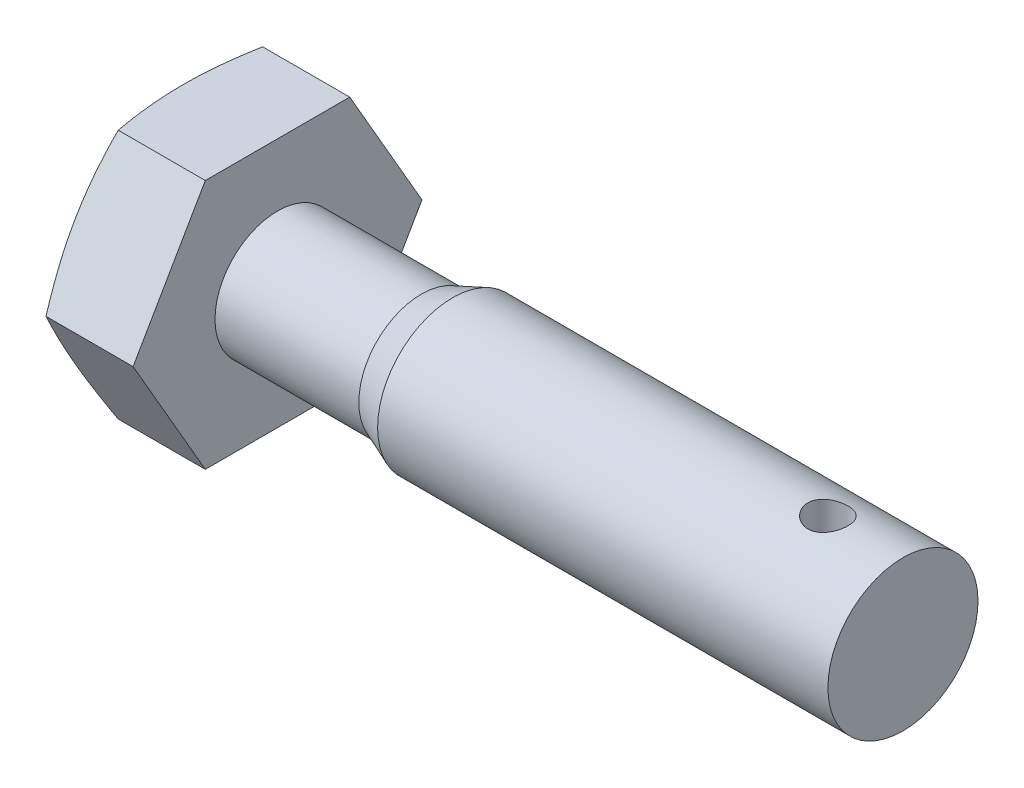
ISO-10303-21;
HEADER;
FILE_DESCRIPTION(('STEP AP214'),'2;1');
FILE_NAME('part.step','',(''),(''),'','','');
FILE_SCHEMA(('AUTOMOTIVE_DESIGN { 1 0 10303 214 1 1 1 1 }'));
ENDSEC;
DATA;
#1=APPLICATION_CONTEXT('core data for automotive mechanical design processes');
#2=APPLICATION_PROTOCOL_DEFINITION('international standard','automotive_design',2000,#1);
#3=PRODUCT_CONTEXT('',#1,'mechanical');
#4=PRODUCT('Part','Part','',(#3));
#5=PRODUCT_RELATED_PRODUCT_CATEGORY('part','',(#4));
#6=PRODUCT_DEFINITION_FORMATION('','',#4);
#7=PRODUCT_DEFINITION_CONTEXT('part definition',#1,'design');
#8=PRODUCT_DEFINITION('design','',#6,#7);
#9=PRODUCT_DEFINITION_SHAPE('','',#8);
#10=(LENGTH_UNIT() NAMED_UNIT(*) SI_UNIT(.MILLI.,.METRE.));
#11=(NAMED_UNIT(*) PLANE_ANGLE_UNIT() SI_UNIT($,.RADIAN.));
#12=(NAMED_UNIT(*) SI_UNIT($,.STERADIAN.) SOLID_ANGLE_UNIT());
#13=UNCERTAINTY_MEASURE_WITH_UNIT(LENGTH_MEASURE(1.E-05),#10,'distance_accuracy_value','');
#14=(GEOMETRIC_REPRESENTATION_CONTEXT(3) GLOBAL_UNCERTAINTY_ASSIGNED_CONTEXT((#13)) GLOBAL_UNIT_ASSIGNED_CONTEXT((#10,
#11,#12)) REPRESENTATION_CONTEXT('',''));
#15=CARTESIAN_POINT('',(0.,0.,0.));
#16=DIRECTION('',(0.,0.,1.));
#17=DIRECTION('',(1.,0.,0.));
#18=AXIS2_PLACEMENT_3D('',#15,#16,#17);
#19=CARTESIAN_POINT('',(0.,-5.,2.88675134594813));
#20=DIRECTION('',(-1.,0.,0.));
#21=DIRECTION('',(0.,0.,1.));
#22=AXIS2_PLACEMENT_3D('',#19,#20,#21);
#23=PLANE('',#22);
#24=CARTESIAN_POINT('',(0.,0.,0.));
#25=DIRECTION('',(-1.,0.,0.));
#26=DIRECTION('',(0.,0.,1.));
#27=AXIS2_PLACEMENT_3D('',#24,#25,#26);
#28=CIRCLE('',#27,4.35);
#29=CARTESIAN_POINT('',(0.,0.,4.35));
#30=VERTEX_POINT('',#29);
#31=EDGE_CURVE('E101',#30,#30,#28,.T.);
#32=ORIENTED_EDGE('',*,*,#31,.T.);
#33=EDGE_LOOP('',(#32));
#34=FACE_BOUND('',#33,.T.);
#35=CARTESIAN_POINT('',(0.,0.,0.));
#36=DIRECTION('',(1.,0.,0.));
#37=DIRECTION('',(0.,0.,-1.));
#38=AXIS2_PLACEMENT_3D('',#35,#36,#37);
#39=CIRCLE('',#38,3.4);
#40=CARTESIAN_POINT('',(0.,0.,-3.4));
#41=VERTEX_POINT('',#40);
#42=EDGE_CURVE('E230',#41,#41,#39,.T.);
#43=ORIENTED_EDGE('',*,*,#42,.T.);
#44=EDGE_LOOP('',(#43));
#45=FACE_BOUND('',#44,.T.);
#46=ADVANCED_FACE('F36',(#34,#45),#23,.T.);
#47=CARTESIAN_POINT('',(4.,-5.,2.88675134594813));
#48=DIRECTION('',(0.,1.,0.));
#49=DIRECTION('',(0.,0.,1.));
#50=AXIS2_PLACEMENT_3D('',#47,#48,#49);
#51=PLANE('',#50);
#52=CARTESIAN_POINT('',(1.73412088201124,-5.,-7.62058685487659));
#53=CARTESIAN_POINT('',(1.66536818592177,-5.,-7.39459725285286));
#54=CARTESIAN_POINT('',(1.5974227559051,-5.,-7.16835746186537));
#55=CARTESIAN_POINT('',(1.46359308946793,-5.,-6.71525017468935));
#56=CARTESIAN_POINT('',(1.39770901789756,-5.,-6.48838262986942));
#57=CARTESIAN_POINT('',(1.26833776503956,-5.,-6.03349928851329));
#58=CARTESIAN_POINT('',(1.20485534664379,-5.,-5.80548213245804));
#59=CARTESIAN_POINT('',(1.08103648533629,-5.,-5.34859642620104));
#60=CARTESIAN_POINT('',(1.02069998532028,-5.,-5.11972789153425));
#61=CARTESIAN_POINT('',(0.904681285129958,-5.,-4.66385371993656));
#62=CARTESIAN_POINT('',(0.848950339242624,-5.,-4.43686055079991));
#63=CARTESIAN_POINT('',(0.742270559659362,-5.,-3.98175526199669));
#64=CARTESIAN_POINT('',(0.691321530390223,-5.,-3.75364318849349));
#65=CARTESIAN_POINT('',(0.595395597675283,-5.,-3.29623351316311));
#66=CARTESIAN_POINT('',(0.550416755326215,-5.,-3.06693632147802));
#67=CARTESIAN_POINT('',(0.467808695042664,-5.,-2.60701194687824));
#68=CARTESIAN_POINT('',(0.43017922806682,-5.,-2.37638480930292));
#69=CARTESIAN_POINT('',(0.367531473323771,-5.,-1.93980954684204));
#70=CARTESIAN_POINT('',(0.341571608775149,-5.,-1.73399780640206));
#71=CARTESIAN_POINT('',(0.297702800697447,-5.,-1.32151095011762));
#72=CARTESIAN_POINT('',(0.279793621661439,-5.,-1.11483585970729));
#73=CARTESIAN_POINT('',(0.2528889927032,-5.,-0.701041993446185));
#74=CARTESIAN_POINT('',(0.243887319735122,-5.,-0.493923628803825));
#75=CARTESIAN_POINT('',(0.235252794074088,-5.,-0.0794895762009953));
#76=CARTESIAN_POINT('',(0.235619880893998,-5.,0.127826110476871));
#77=CARTESIAN_POINT('',(0.245728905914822,-5.,0.543296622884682));
#78=CARTESIAN_POINT('',(0.255519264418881,-5.,0.751450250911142));
#79=CARTESIAN_POINT('',(0.284025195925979,-5.,1.16714016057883));
#80=CARTESIAN_POINT('',(0.30274098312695,-5.,1.37467642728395));
#81=CARTESIAN_POINT('',(0.348227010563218,-5.,1.78903168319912));
#82=CARTESIAN_POINT('',(0.375004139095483,-5.,1.99584990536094));
#83=CARTESIAN_POINT('',(0.435533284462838,-5.,2.408451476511));
#84=CARTESIAN_POINT('',(0.469285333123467,-5.,2.61423482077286));
#85=CARTESIAN_POINT('',(0.544976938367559,-5.,3.03762754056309));
#86=CARTESIAN_POINT('',(0.587297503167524,-5.,3.25516820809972));
#87=CARTESIAN_POINT('',(0.677388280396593,-5.,3.68912540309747));
#88=CARTESIAN_POINT('',(0.72515891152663,-5.,3.90554184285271));
#89=CARTESIAN_POINT('',(0.825138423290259,-5.,4.3374083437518));
#90=CARTESIAN_POINT('',(0.877348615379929,-5.,4.55285809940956));
#91=CARTESIAN_POINT('',(0.985352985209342,-5.,4.98284735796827));
#92=CARTESIAN_POINT('',(1.04114707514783,-5.,5.19738688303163));
#93=CARTESIAN_POINT('',(1.15571790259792,-5.,5.62596240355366));
#94=CARTESIAN_POINT('',(1.2144984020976,-5.,5.83999738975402));
#95=CARTESIAN_POINT('',(1.33444153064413,-5.,6.26740010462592));
#96=CARTESIAN_POINT('',(1.395604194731,-5.,6.48076782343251));
#97=CARTESIAN_POINT('',(1.5819781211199,-5.,7.1199437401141));
#98=CARTESIAN_POINT('',(1.71009677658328,-5.,7.54490360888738));
#99=CARTESIAN_POINT('',(1.97013168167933,-5.,8.38829124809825));
#100=CARTESIAN_POINT('',(2.10198722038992,-5.,8.80673789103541));
#101=CARTESIAN_POINT('',(2.36941134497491,-5.,9.64246317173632));
#102=CARTESIAN_POINT('',(2.50498011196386,-5.,10.0597417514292));
#103=CARTESIAN_POINT('',(2.77829656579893,-5.,10.8918203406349));
#104=CARTESIAN_POINT('',(2.91603397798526,-5.,11.3066237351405));
#105=CARTESIAN_POINT('',(3.19355173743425,-5.,12.1355089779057));
#106=CARTESIAN_POINT('',(3.33333191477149,-5.,12.5495908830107));
#107=CARTESIAN_POINT('',(3.47382628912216,-5.,12.9634270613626));
#108=B_SPLINE_CURVE_WITH_KNOTS('',3,(#52,#53,#54,#55,#56,#57,#58,#59,#60,#61,#62,#63,#64,#65,
#66,#67,#68,#69,#70,#71,#72,#73,#74,#75,#76,#77,#78,#79,#80,#81,#82,#83,#84,#85,#86,#87,#88,#89,
#90,#91,#92,#93,#94,#95,#96,#97,#98,#99,#100,#101,#102,#103,#104,#105,#106,#107),.UNSPECIFIED.,
.F.,.F.,(4,2,2,2,2,2,2,2,2,2,2,2,2,2,2,2,2,2,2,2,2,2,2,2,2,2,2,4),(0.,0.708654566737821,
1.4173656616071,2.1274155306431,2.83745250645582,3.53861525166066,4.23974930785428,
4.94065510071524,5.64153713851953,6.26372739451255,6.88589944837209,7.50763652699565,
8.129369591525,8.75431450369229,9.37927441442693,10.0047698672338,10.6302681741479,
11.2950391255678,11.9598611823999,12.6248803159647,13.2898831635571,13.9557455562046,
14.6216177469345,15.9531168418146,17.269284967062,18.585517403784,19.8967329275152,
21.2078399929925),.UNSPECIFIED.);
#109=CARTESIAN_POINT('',(0.518112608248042,-5.,-2.88675134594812));
#110=VERTEX_POINT('',#109);
#111=CARTESIAN_POINT('',(0.518112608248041,-5.,2.88675134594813));
#112=VERTEX_POINT('',#111);
#113=EDGE_CURVE('E58',#110,#112,#108,.T.);
#114=ORIENTED_EDGE('',*,*,#113,.F.);
#115=DIRECTION('',(-1.,0.,0.));
#116=VECTOR('',#115,1.);
#117=CARTESIAN_POINT('',(4.,-5.,-2.88675134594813));
#118=LINE('',#117,#116);
#119=CARTESIAN_POINT('',(4.,-5.,-2.88675134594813));
#120=VERTEX_POINT('',#119);
#121=EDGE_CURVE('E11',#120,#110,#118,.T.);
#122=ORIENTED_EDGE('',*,*,#121,.F.);
#123=DIRECTION('',(0.,0.,-1.));
#124=VECTOR('',#123,1.);
#125=CARTESIAN_POINT('',(4.,-5.,2.88675134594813));
#126=LINE('',#125,#124);
#127=CARTESIAN_POINT('',(4.,-5.,2.88675134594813));
#128=VERTEX_POINT('',#127);
#129=EDGE_CURVE('E257',#128,#120,#126,.T.);
#130=ORIENTED_EDGE('',*,*,#129,.F.);
#131=DIRECTION('',(-1.,0.,0.));
#132=VECTOR('',#131,1.);
#133=CARTESIAN_POINT('',(4.,-5.,2.88675134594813));
#134=LINE('',#133,#132);
#135=EDGE_CURVE('E114',#128,#112,#134,.T.);
#136=ORIENTED_EDGE('',*,*,#135,.T.);
#137=EDGE_LOOP('',(#114,#122,#130,#136));
#138=FACE_BOUND('',#137,.T.);
#139=ADVANCED_FACE('F38',(#138),#51,.F.);
#140=CARTESIAN_POINT('',(4.,-5.,-2.88675134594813));
#141=DIRECTION('',(0.,0.5,0.866025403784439));
#142=DIRECTION('',(0.,-0.866025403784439,0.5));
#143=AXIS2_PLACEMENT_3D('',#140,#141,#142);
#144=PLANE('',#143);
#145=CARTESIAN_POINT('',(0.518154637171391,0.000200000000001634,-5.77361816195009));
#146=CARTESIAN_POINT('',(0.474622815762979,-0.206877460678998,-5.65406193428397));
#147=CARTESIAN_POINT('',(0.435023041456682,-0.414637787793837,-5.53411145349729));
#148=CARTESIAN_POINT('',(0.365353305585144,-0.83150936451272,-5.29343053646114));
#149=CARTESIAN_POINT('',(0.335290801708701,-1.04062154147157,-5.17269956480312));
#150=CARTESIAN_POINT('',(0.286665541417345,-1.45787607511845,-4.93179754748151));
#151=CARTESIAN_POINT('',(0.267996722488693,-1.66600890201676,-4.81163200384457));
#152=CARTESIAN_POINT('',(0.242956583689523,-2.08276129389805,-4.57101989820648));
#153=CARTESIAN_POINT('',(0.236580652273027,-2.29138064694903,-4.45057345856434));
#154=CARTESIAN_POINT('',(0.236580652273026,-2.70861935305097,-4.20968057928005));
#155=CARTESIAN_POINT('',(0.242956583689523,-2.91723870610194,-4.0892341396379));
#156=CARTESIAN_POINT('',(0.267996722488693,-3.33399109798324,-3.84862203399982));
#157=CARTESIAN_POINT('',(0.286665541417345,-3.54212392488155,-3.72845649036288));
#158=CARTESIAN_POINT('',(0.335290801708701,-3.95937845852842,-3.48755447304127));
#159=CARTESIAN_POINT('',(0.365353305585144,-4.16849063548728,-3.36682350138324));
#160=CARTESIAN_POINT('',(0.435023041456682,-4.58536221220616,-3.12614258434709));
#161=CARTESIAN_POINT('',(0.474622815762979,-4.793122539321,-3.00619210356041));
#162=CARTESIAN_POINT('',(0.518154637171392,-5.0002,-2.88663587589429));
#163=B_SPLINE_CURVE_WITH_KNOTS('',3,(#145,#146,#147,#148,#149,#150,#151,#152,#153,#154,#155,
#156,#157,#158,#159,#160,#161,#162),.UNSPECIFIED.,.F.,.F.,(4,2,2,2,2,2,2,2,4),(0.,
0.729203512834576,1.45897583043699,2.18184682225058,2.90444658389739,3.6270463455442,
4.3499173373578,5.07968965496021,5.80889316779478),.UNSPECIFIED.);
#164=CARTESIAN_POINT('',(0.518112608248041,0.,-5.77350269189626));
#165=VERTEX_POINT('',#164);
#166=EDGE_CURVE('E186',#165,#110,#163,.T.);
#167=ORIENTED_EDGE('',*,*,#166,.F.);
#168=DIRECTION('',(-1.,0.,0.));
#169=VECTOR('',#168,1.);
#170=CARTESIAN_POINT('',(4.,0.,-5.77350269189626));
#171=LINE('',#170,#169);
#172=CARTESIAN_POINT('',(4.,0.,-5.77350269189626));
#173=VERTEX_POINT('',#172);
#174=EDGE_CURVE('E50',#173,#165,#171,.T.);
#175=ORIENTED_EDGE('',*,*,#174,.F.);
#176=DIRECTION('',(0.,0.866025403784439,-0.5));
#177=VECTOR('',#176,1.);
#178=CARTESIAN_POINT('',(4.,-5.,-2.88675134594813));
#179=LINE('',#178,#177);
#180=EDGE_CURVE('E258',#120,#173,#179,.T.);
#181=ORIENTED_EDGE('',*,*,#180,.F.);
#182=ORIENTED_EDGE('',*,*,#121,.T.);
#183=EDGE_LOOP('',(#167,#175,#181,#182));
#184=FACE_BOUND('',#183,.T.);
#185=ADVANCED_FACE('F194',(#184),#144,.F.);
#186=CARTESIAN_POINT('',(4.,0.,-5.77350269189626));
#187=DIRECTION('',(0.,-0.5,0.866025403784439));
#188=DIRECTION('',(0.,-0.866025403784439,-0.5));
#189=AXIS2_PLACEMENT_3D('',#186,#187,#188);
#190=PLANE('',#189);
#191=CARTESIAN_POINT('',(0.518154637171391,5.0002,-2.88663587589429));
#192=CARTESIAN_POINT('',(0.474622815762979,4.793122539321,-3.00619210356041));
#193=CARTESIAN_POINT('',(0.435023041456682,4.58536221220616,-3.12614258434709));
#194=CARTESIAN_POINT('',(0.365353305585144,4.16849063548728,-3.36682350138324));
#195=CARTESIAN_POINT('',(0.335290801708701,3.95937845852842,-3.48755447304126));
#196=CARTESIAN_POINT('',(0.286665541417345,3.54212392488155,-3.72845649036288));
#197=CARTESIAN_POINT('',(0.267996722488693,3.33399109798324,-3.84862203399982));
#198=CARTESIAN_POINT('',(0.242956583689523,2.91723870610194,-4.0892341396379));
#199=CARTESIAN_POINT('',(0.236580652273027,2.70861935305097,-4.20968057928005));
#200=CARTESIAN_POINT('',(0.236580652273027,2.29138064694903,-4.45057345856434));
#201=CARTESIAN_POINT('',(0.242956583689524,2.08276129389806,-4.57101989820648));
#202=CARTESIAN_POINT('',(0.267996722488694,1.66600890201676,-4.81163200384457));
#203=CARTESIAN_POINT('',(0.286665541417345,1.45787607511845,-4.9317975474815));
#204=CARTESIAN_POINT('',(0.335290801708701,1.04062154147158,-5.17269956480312));
#205=CARTESIAN_POINT('',(0.365353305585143,0.831509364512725,-5.29343053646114));
#206=CARTESIAN_POINT('',(0.435023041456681,0.414637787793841,-5.53411145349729));
#207=CARTESIAN_POINT('',(0.474622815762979,0.206877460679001,-5.65406193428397));
#208=CARTESIAN_POINT('',(0.518154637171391,-0.000199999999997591,-5.77361816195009));
#209=B_SPLINE_CURVE_WITH_KNOTS('',3,(#191,#192,#193,#194,#195,#196,#197,#198,#199,#200,#201,
#202,#203,#204,#205,#206,#207,#208),.UNSPECIFIED.,.F.,.F.,(4,2,2,2,2,2,2,2,4),(0.,
0.729203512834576,1.45897583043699,2.18184682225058,2.90444658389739,3.6270463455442,
4.34991733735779,5.0796896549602,5.80889316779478),.UNSPECIFIED.);
#210=CARTESIAN_POINT('',(0.518112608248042,5.,-2.88675134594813));
#211=VERTEX_POINT('',#210);
#212=EDGE_CURVE('E180',#211,#165,#209,.T.);
#213=ORIENTED_EDGE('',*,*,#212,.F.);
#214=DIRECTION('',(-1.,0.,0.));
#215=VECTOR('',#214,1.);
#216=CARTESIAN_POINT('',(4.,5.,-2.88675134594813));
#217=LINE('',#216,#215);
#218=CARTESIAN_POINT('',(4.,5.,-2.88675134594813));
#219=VERTEX_POINT('',#218);
#220=EDGE_CURVE('E116',#219,#211,#217,.T.);
#221=ORIENTED_EDGE('',*,*,#220,.F.);
#222=DIRECTION('',(0.,0.866025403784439,0.5));
#223=VECTOR('',#222,1.);
#224=CARTESIAN_POINT('',(4.,0.,-5.77350269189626));
#225=LINE('',#224,#223);
#226=EDGE_CURVE('E262',#173,#219,#225,.T.);
#227=ORIENTED_EDGE('',*,*,#226,.F.);
#228=ORIENTED_EDGE('',*,*,#174,.T.);
#229=EDGE_LOOP('',(#213,#221,#227,#228));
#230=FACE_BOUND('',#229,.T.);
#231=ADVANCED_FACE('F197',(#230),#190,.F.);
#232=CARTESIAN_POINT('',(4.,5.,-2.88675134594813));
#233=DIRECTION('',(0.,-1.,0.));
#234=DIRECTION('',(0.,0.,-1.));
#235=AXIS2_PLACEMENT_3D('',#232,#233,#234);
#236=PLANE('',#235);
#237=CARTESIAN_POINT('',(1.73412088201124,5.,-7.62058685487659));
#238=CARTESIAN_POINT('',(1.66536818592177,5.,-7.39459725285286));
#239=CARTESIAN_POINT('',(1.5974227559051,5.,-7.16835746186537));
#240=CARTESIAN_POINT('',(1.46359308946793,5.,-6.71525017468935));
#241=CARTESIAN_POINT('',(1.39770901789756,5.,-6.48838262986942));
#242=CARTESIAN_POINT('',(1.26833776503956,5.,-6.03349928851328));
#243=CARTESIAN_POINT('',(1.20485534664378,5.,-5.80548213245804));
#244=CARTESIAN_POINT('',(1.08103648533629,5.,-5.34859642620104));
#245=CARTESIAN_POINT('',(1.02069998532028,5.,-5.11972789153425));
#246=CARTESIAN_POINT('',(0.904681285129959,5.,-4.66385371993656));
#247=CARTESIAN_POINT('',(0.848950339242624,5.,-4.43686055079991));
#248=CARTESIAN_POINT('',(0.742270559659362,5.,-3.98175526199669));
#249=CARTESIAN_POINT('',(0.691321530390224,5.,-3.75364318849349));
#250=CARTESIAN_POINT('',(0.595395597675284,5.,-3.29623351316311));
#251=CARTESIAN_POINT('',(0.550416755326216,5.,-3.06693632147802));
#252=CARTESIAN_POINT('',(0.467808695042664,5.,-2.60701194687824));
#253=CARTESIAN_POINT('',(0.43017922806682,5.,-2.37638480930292));
#254=CARTESIAN_POINT('',(0.367531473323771,5.,-1.93980954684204));
#255=CARTESIAN_POINT('',(0.341571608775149,5.,-1.73399780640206));
#256=CARTESIAN_POINT('',(0.297702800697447,5.,-1.32151095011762));
#257=CARTESIAN_POINT('',(0.279793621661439,5.,-1.11483585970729));
#258=CARTESIAN_POINT('',(0.252888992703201,5.,-0.701041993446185));
#259=CARTESIAN_POINT('',(0.243887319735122,5.,-0.493923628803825));
#260=CARTESIAN_POINT('',(0.235252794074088,5.,-0.0794895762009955));
#261=CARTESIAN_POINT('',(0.235619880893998,5.,0.127826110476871));
#262=CARTESIAN_POINT('',(0.245728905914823,5.,0.543296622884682));
#263=CARTESIAN_POINT('',(0.255519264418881,5.,0.751450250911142));
#264=CARTESIAN_POINT('',(0.28402519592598,5.,1.16714016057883));
#265=CARTESIAN_POINT('',(0.30274098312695,5.,1.37467642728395));
#266=CARTESIAN_POINT('',(0.348227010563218,5.,1.78903168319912));
#267=CARTESIAN_POINT('',(0.375004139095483,5.,1.99584990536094));
#268=CARTESIAN_POINT('',(0.435533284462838,5.,2.408451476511));
#269=CARTESIAN_POINT('',(0.469285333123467,5.,2.61423482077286));
#270=CARTESIAN_POINT('',(0.544976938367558,5.,3.03762754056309));
#271=CARTESIAN_POINT('',(0.587297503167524,5.,3.25516820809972));
#272=CARTESIAN_POINT('',(0.677388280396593,5.,3.68912540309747));
#273=CARTESIAN_POINT('',(0.72515891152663,5.,3.90554184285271));
#274=CARTESIAN_POINT('',(0.825138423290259,5.,4.3374083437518));
#275=CARTESIAN_POINT('',(0.877348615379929,5.,4.55285809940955));
#276=CARTESIAN_POINT('',(0.985352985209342,5.,4.98284735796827));
#277=CARTESIAN_POINT('',(1.04114707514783,5.,5.19738688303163));
#278=CARTESIAN_POINT('',(1.15571790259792,5.,5.62596240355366));
#279=CARTESIAN_POINT('',(1.2144984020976,5.,5.83999738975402));
#280=CARTESIAN_POINT('',(1.33444153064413,5.,6.26740010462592));
#281=CARTESIAN_POINT('',(1.395604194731,5.,6.48076782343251));
#282=CARTESIAN_POINT('',(1.5819781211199,5.,7.1199437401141));
#283=CARTESIAN_POINT('',(1.71009677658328,5.,7.54490360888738));
#284=CARTESIAN_POINT('',(1.97013168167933,5.,8.38829124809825));
#285=CARTESIAN_POINT('',(2.10198722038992,5.,8.80673789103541));
#286=CARTESIAN_POINT('',(2.36941134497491,5.,9.64246317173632));
#287=CARTESIAN_POINT('',(2.50498011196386,5.,10.0597417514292));
#288=CARTESIAN_POINT('',(2.77829656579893,5.,10.8918203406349));
#289=CARTESIAN_POINT('',(2.91603397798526,5.,11.3066237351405));
#290=CARTESIAN_POINT('',(3.19355173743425,5.,12.1355089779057));
#291=CARTESIAN_POINT('',(3.33333191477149,5.,12.5495908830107));
#292=CARTESIAN_POINT('',(3.47382628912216,5.,12.9634270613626));
#293=B_SPLINE_CURVE_WITH_KNOTS('',3,(#237,#238,#239,#240,#241,#242,#243,#244,#245,#246,#247,
#248,#249,#250,#251,#252,#253,#254,#255,#256,#257,#258,#259,#260,#261,#262,#263,#264,#265,#266,
#267,#268,#269,#270,#271,#272,#273,#274,#275,#276,#277,#278,#279,#280,#281,#282,#283,#284,#285,
#286,#287,#288,#289,#290,#291,#292),.UNSPECIFIED.,.F.,.F.,(4,2,2,2,2,2,2,2,2,2,2,2,2,2,2,2,2,2,
2,2,2,2,2,2,2,2,2,4),(0.,0.708654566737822,1.4173656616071,2.1274155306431,2.83745250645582,
3.53861525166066,4.23974930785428,4.94065510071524,5.64153713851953,6.26372739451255,
6.88589944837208,7.50763652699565,8.129369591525,8.75431450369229,9.37927441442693,
10.0047698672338,10.6302681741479,11.2950391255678,11.9598611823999,12.6248803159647,
13.2898831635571,13.9557455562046,14.6216177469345,15.9531168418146,17.269284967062,
18.585517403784,19.8967329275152,21.2078399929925),.UNSPECIFIED.);
#294=CARTESIAN_POINT('',(0.518112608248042,5.,2.88675134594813));
#295=VERTEX_POINT('',#294);
#296=EDGE_CURVE('E111',#295,#211,#293,.F.);
#297=ORIENTED_EDGE('',*,*,#296,.F.);
#298=DIRECTION('',(-1.,0.,0.));
#299=VECTOR('',#298,1.);
#300=CARTESIAN_POINT('',(4.,5.,2.88675134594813));
#301=LINE('',#300,#299);
#302=CARTESIAN_POINT('',(4.,5.,2.88675134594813));
#303=VERTEX_POINT('',#302);
#304=EDGE_CURVE('E110',#303,#295,#301,.T.);
#305=ORIENTED_EDGE('',*,*,#304,.F.);
#306=DIRECTION('',(0.,0.,1.));
#307=VECTOR('',#306,1.);
#308=CARTESIAN_POINT('',(4.,5.,-2.88675134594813));
#309=LINE('',#308,#307);
#310=EDGE_CURVE('E264',#219,#303,#309,.T.);
#311=ORIENTED_EDGE('',*,*,#310,.F.);
#312=ORIENTED_EDGE('',*,*,#220,.T.);
#313=EDGE_LOOP('',(#297,#305,#311,#312));
#314=FACE_BOUND('',#313,.T.);
#315=ADVANCED_FACE('F201',(#314),#236,.F.);
#316=CARTESIAN_POINT('',(4.,5.,2.88675134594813));
#317=DIRECTION('',(0.,-0.5,-0.866025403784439));
#318=DIRECTION('',(0.,0.866025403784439,-0.5));
#319=AXIS2_PLACEMENT_3D('',#316,#317,#318);
#320=PLANE('',#319);
#321=CARTESIAN_POINT('',(0.518154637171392,-0.000199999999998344,5.77361816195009));
#322=CARTESIAN_POINT('',(0.47462281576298,0.206877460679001,5.65406193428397));
#323=CARTESIAN_POINT('',(0.435023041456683,0.41463778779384,5.53411145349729));
#324=CARTESIAN_POINT('',(0.365353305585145,0.831509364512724,5.29343053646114));
#325=CARTESIAN_POINT('',(0.335290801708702,1.04062154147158,5.17269956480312));
#326=CARTESIAN_POINT('',(0.286665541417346,1.45787607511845,4.9317975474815));
#327=CARTESIAN_POINT('',(0.267996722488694,1.66600890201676,4.81163200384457));
#328=CARTESIAN_POINT('',(0.242956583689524,2.08276129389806,4.57101989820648));
#329=CARTESIAN_POINT('',(0.236580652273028,2.29138064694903,4.45057345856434));
#330=CARTESIAN_POINT('',(0.236580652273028,2.70861935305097,4.20968057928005));
#331=CARTESIAN_POINT('',(0.242956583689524,2.91723870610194,4.0892341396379));
#332=CARTESIAN_POINT('',(0.267996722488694,3.33399109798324,3.84862203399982));
#333=CARTESIAN_POINT('',(0.286665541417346,3.54212392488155,3.72845649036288));
#334=CARTESIAN_POINT('',(0.335290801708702,3.95937845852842,3.48755447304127));
#335=CARTESIAN_POINT('',(0.365353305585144,4.16849063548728,3.36682350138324));
#336=CARTESIAN_POINT('',(0.435023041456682,4.58536221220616,3.12614258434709));
#337=CARTESIAN_POINT('',(0.47462281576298,4.793122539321,3.00619210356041));
#338=CARTESIAN_POINT('',(0.518154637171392,5.0002,2.88663587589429));
#339=B_SPLINE_CURVE_WITH_KNOTS('',3,(#321,#322,#323,#324,#325,#326,#327,#328,#329,#330,#331,
#332,#333,#334,#335,#336,#337,#338),.UNSPECIFIED.,.F.,.F.,(4,2,2,2,2,2,2,2,4),(0.,
0.729203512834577,1.45897583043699,2.18184682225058,2.90444658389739,3.6270463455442,
4.34991733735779,5.0796896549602,5.80889316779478),.UNSPECIFIED.);
#340=CARTESIAN_POINT('',(0.518112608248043,0.,5.77350269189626));
#341=VERTEX_POINT('',#340);
#342=EDGE_CURVE('E96',#341,#295,#339,.T.);
#343=ORIENTED_EDGE('',*,*,#342,.F.);
#344=DIRECTION('',(-1.,0.,0.));
#345=VECTOR('',#344,1.);
#346=CARTESIAN_POINT('',(4.,0.,5.77350269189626));
#347=LINE('',#346,#345);
#348=CARTESIAN_POINT('',(4.,0.,5.77350269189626));
#349=VERTEX_POINT('',#348);
#350=EDGE_CURVE('E108',#349,#341,#347,.T.);
#351=ORIENTED_EDGE('',*,*,#350,.F.);
#352=DIRECTION('',(0.,-0.866025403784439,0.5));
#353=VECTOR('',#352,1.);
#354=CARTESIAN_POINT('',(4.,5.,2.88675134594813));
#355=LINE('',#354,#353);
#356=EDGE_CURVE('E266',#303,#349,#355,.T.);
#357=ORIENTED_EDGE('',*,*,#356,.F.);
#358=ORIENTED_EDGE('',*,*,#304,.T.);
#359=EDGE_LOOP('',(#343,#351,#357,#358));
#360=FACE_BOUND('',#359,.T.);
#361=ADVANCED_FACE('F106',(#360),#320,.F.);
#362=CARTESIAN_POINT('',(4.,0.,5.77350269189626));
#363=DIRECTION('',(0.,0.5,-0.866025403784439));
#364=DIRECTION('',(0.,0.866025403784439,0.5));
#365=AXIS2_PLACEMENT_3D('',#362,#363,#364);
#366=PLANE('',#365);
#367=CARTESIAN_POINT('',(0.518154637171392,-5.0002,2.88663587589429));
#368=CARTESIAN_POINT('',(0.47462281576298,-4.793122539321,3.00619210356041));
#369=CARTESIAN_POINT('',(0.435023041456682,-4.58536221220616,3.12614258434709));
#370=CARTESIAN_POINT('',(0.365353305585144,-4.16849063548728,3.36682350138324));
#371=CARTESIAN_POINT('',(0.335290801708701,-3.95937845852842,3.48755447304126));
#372=CARTESIAN_POINT('',(0.286665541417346,-3.54212392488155,3.72845649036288));
#373=CARTESIAN_POINT('',(0.267996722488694,-3.33399109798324,3.84862203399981));
#374=CARTESIAN_POINT('',(0.242956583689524,-2.91723870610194,4.0892341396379));
#375=CARTESIAN_POINT('',(0.236580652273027,-2.70861935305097,4.20968057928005));
#376=CARTESIAN_POINT('',(0.236580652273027,-2.29138064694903,4.45057345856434));
#377=CARTESIAN_POINT('',(0.242956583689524,-2.08276129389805,4.57101989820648));
#378=CARTESIAN_POINT('',(0.267996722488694,-1.66600890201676,4.81163200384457));
#379=CARTESIAN_POINT('',(0.286665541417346,-1.45787607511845,4.9317975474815));
#380=CARTESIAN_POINT('',(0.335290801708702,-1.04062154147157,5.17269956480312));
#381=CARTESIAN_POINT('',(0.365353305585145,-0.831509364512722,5.29343053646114));
#382=CARTESIAN_POINT('',(0.435023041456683,-0.414637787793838,5.53411145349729));
#383=CARTESIAN_POINT('',(0.47462281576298,-0.206877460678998,5.65406193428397));
#384=CARTESIAN_POINT('',(0.518154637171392,0.000200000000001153,5.77361816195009));
#385=B_SPLINE_CURVE_WITH_KNOTS('',3,(#367,#368,#369,#370,#371,#372,#373,#374,#375,#376,#377,
#378,#379,#380,#381,#382,#383,#384),.UNSPECIFIED.,.F.,.F.,(4,2,2,2,2,2,2,2,4),(0.,
0.729203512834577,1.45897583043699,2.18184682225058,2.90444658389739,3.6270463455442,
4.3499173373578,5.0796896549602,5.80889316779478),.UNSPECIFIED.);
#386=EDGE_CURVE('E93',#112,#341,#385,.T.);
#387=ORIENTED_EDGE('',*,*,#386,.F.);
#388=ORIENTED_EDGE('',*,*,#135,.F.);
#389=DIRECTION('',(0.,-0.866025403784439,-0.5));
#390=VECTOR('',#389,1.);
#391=CARTESIAN_POINT('',(4.,0.,5.77350269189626));
#392=LINE('',#391,#390);
#393=EDGE_CURVE('E66',#349,#128,#392,.T.);
#394=ORIENTED_EDGE('',*,*,#393,.F.);
#395=ORIENTED_EDGE('',*,*,#350,.T.);
#396=EDGE_LOOP('',(#387,#388,#394,#395));
#397=FACE_BOUND('',#396,.T.);
#398=ADVANCED_FACE('F113',(#397),#366,.F.);
#399=CARTESIAN_POINT('',(4.,-5.,2.88675134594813));
#400=DIRECTION('',(-1.,0.,0.));
#401=DIRECTION('',(0.,0.,1.));
#402=AXIS2_PLACEMENT_3D('',#399,#400,#401);
#403=PLANE('',#402);
#404=ORIENTED_EDGE('',*,*,#393,.T.);
#405=ORIENTED_EDGE('',*,*,#129,.T.);
#406=ORIENTED_EDGE('',*,*,#180,.T.);
#407=ORIENTED_EDGE('',*,*,#226,.T.);
#408=ORIENTED_EDGE('',*,*,#310,.T.);
#409=ORIENTED_EDGE('',*,*,#356,.T.);
#410=EDGE_LOOP('',(#404,#405,#406,#407,#408,#409));
#411=FACE_BOUND('',#410,.T.);
#412=CARTESIAN_POINT('',(4.,0.,0.));
#413=DIRECTION('',(-1.,0.,0.));
#414=DIRECTION('',(0.,0.,1.));
#415=AXIS2_PLACEMENT_3D('',#412,#413,#414);
#416=CIRCLE('',#415,2.5);
#417=CARTESIAN_POINT('',(4.,0.,2.5));
#418=VERTEX_POINT('',#417);
#419=EDGE_CURVE('E219',#418,#418,#416,.T.);
#420=ORIENTED_EDGE('',*,*,#419,.T.);
#421=EDGE_LOOP('',(#420));
#422=FACE_BOUND('',#421,.T.);
#423=ADVANCED_FACE('F157',(#411,#422),#403,.F.);
#424=CARTESIAN_POINT('',(0.,0.,0.));
#425=DIRECTION('',(1.,0.,0.));
#426=DIRECTION('',(0.,0.,-1.));
#427=AXIS2_PLACEMENT_3D('',#424,#425,#426);
#428=CONICAL_SURFACE('',#427,4.35,1.22173047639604);
#429=ORIENTED_EDGE('',*,*,#31,.F.);
#430=EDGE_LOOP('',(#429));
#431=FACE_BOUND('',#430,.T.);
#432=ORIENTED_EDGE('',*,*,#113,.T.);
#433=ORIENTED_EDGE('',*,*,#386,.T.);
#434=ORIENTED_EDGE('',*,*,#342,.T.);
#435=ORIENTED_EDGE('',*,*,#296,.T.);
#436=ORIENTED_EDGE('',*,*,#212,.T.);
#437=ORIENTED_EDGE('',*,*,#166,.T.);
#438=EDGE_LOOP('',(#432,#433,#434,#435,#436,#437));
#439=FACE_BOUND('',#438,.T.);
#440=ADVANCED_FACE('F95',(#431,#439),#428,.T.);
#441=CARTESIAN_POINT('',(0.8,0.,0.));
#442=DIRECTION('',(-1.,0.,0.));
#443=DIRECTION('',(0.,0.,1.));
#444=AXIS2_PLACEMENT_3D('',#441,#442,#443);
#445=CYLINDRICAL_SURFACE('',#444,3.4);
#446=CARTESIAN_POINT('',(0.8,0.,0.));
#447=DIRECTION('',(1.,0.,0.));
#448=DIRECTION('',(0.,0.,-1.));
#449=AXIS2_PLACEMENT_3D('',#446,#447,#448);
#450=CIRCLE('',#449,3.4);
#451=CARTESIAN_POINT('',(0.8,0.,-3.4));
#452=VERTEX_POINT('',#451);
#453=EDGE_CURVE('E231',#452,#452,#450,.T.);
#454=ORIENTED_EDGE('',*,*,#453,.T.);
#455=EDGE_LOOP('',(#454));
#456=FACE_BOUND('',#455,.T.);
#457=ORIENTED_EDGE('',*,*,#42,.F.);
#458=EDGE_LOOP('',(#457));
#459=FACE_BOUND('',#458,.T.);
#460=ADVANCED_FACE('F150',(#456,#459),#445,.F.);
#461=CARTESIAN_POINT('',(0.8,0.,0.));
#462=DIRECTION('',(1.,0.,0.));
#463=DIRECTION('',(0.,0.,-1.));
#464=AXIS2_PLACEMENT_3D('',#461,#462,#463);
#465=PLANE('',#464);
#466=ORIENTED_EDGE('',*,*,#453,.F.);
#467=EDGE_LOOP('',(#466));
#468=FACE_BOUND('',#467,.T.);
#469=ADVANCED_FACE('F146',(#468),#465,.F.);
#470=CARTESIAN_POINT('',(9.75000000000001,0.,0.));
#471=DIRECTION('',(1.,0.,0.));
#472=DIRECTION('',(0.,0.,-1.));
#473=AXIS2_PLACEMENT_3D('',#470,#471,#472);
#474=CONICAL_SURFACE('',#473,2.5,0.380506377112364);
#475=CARTESIAN_POINT('',(11.,0.,0.));
#476=DIRECTION('',(-1.,0.,0.));
#477=DIRECTION('',(0.,0.,1.));
#478=AXIS2_PLACEMENT_3D('',#475,#476,#477);
#479=CIRCLE('',#478,3.);
#480=CARTESIAN_POINT('',(11.,0.,3.));
#481=VERTEX_POINT('',#480);
#482=EDGE_CURVE('E224',#481,#481,#479,.T.);
#483=ORIENTED_EDGE('',*,*,#482,.T.);
#484=EDGE_LOOP('',(#483));
#485=FACE_BOUND('',#484,.T.);
#486=CARTESIAN_POINT('',(9.75000000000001,0.,0.));
#487=DIRECTION('',(-1.,0.,0.));
#488=DIRECTION('',(0.,0.,1.));
#489=AXIS2_PLACEMENT_3D('',#486,#487,#488);
#490=CIRCLE('',#489,2.5);
#491=CARTESIAN_POINT('',(9.75000000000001,0.,2.5));
#492=VERTEX_POINT('',#491);
#493=EDGE_CURVE('E221',#492,#492,#490,.T.);
#494=ORIENTED_EDGE('',*,*,#493,.F.);
#495=EDGE_LOOP('',(#494));
#496=FACE_BOUND('',#495,.T.);
#497=ADVANCED_FACE('F142',(#485,#496),#474,.T.);
#498=CARTESIAN_POINT('',(0.,0.,0.));
#499=DIRECTION('',(-1.,0.,0.));
#500=DIRECTION('',(0.,0.,1.));
#501=AXIS2_PLACEMENT_3D('',#498,#499,#500);
#502=CYLINDRICAL_SURFACE('',#501,2.5);
#503=ORIENTED_EDGE('',*,*,#493,.T.);
#504=EDGE_LOOP('',(#503));
#505=FACE_BOUND('',#504,.T.);
#506=ORIENTED_EDGE('',*,*,#419,.F.);
#507=EDGE_LOOP('',(#506));
#508=FACE_BOUND('',#507,.T.);
#509=ADVANCED_FACE('F137',(#505,#508),#502,.T.);
#510=CARTESIAN_POINT('',(29.,0.,0.));
#511=DIRECTION('',(1.,0.,0.));
#512=DIRECTION('',(0.,0.,-1.));
#513=AXIS2_PLACEMENT_3D('',#510,#511,#512);
#514=PLANE('',#513);
#515=CARTESIAN_POINT('',(29.,0.,0.));
#516=DIRECTION('',(1.,0.,0.));
#517=DIRECTION('',(0.,0.,-1.));
#518=AXIS2_PLACEMENT_3D('',#515,#516,#517);
#519=CIRCLE('',#518,3.);
#520=CARTESIAN_POINT('',(29.,0.,-3.));
#521=VERTEX_POINT('',#520);
#522=EDGE_CURVE('E256',#521,#521,#519,.T.);
#523=ORIENTED_EDGE('',*,*,#522,.T.);
#524=EDGE_LOOP('',(#523));
#525=FACE_BOUND('',#524,.T.);
#526=ADVANCED_FACE('F141',(#525),#514,.T.);
#527=CARTESIAN_POINT('',(29.,0.,0.));
#528=DIRECTION('',(-1.,0.,0.));
#529=DIRECTION('',(0.,0.,1.));
#530=AXIS2_PLACEMENT_3D('',#527,#528,#529);
#531=CYLINDRICAL_SURFACE('',#530,3.);
#532=CARTESIAN_POINT('',(26.,-2.89136645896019,0.799999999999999));
#533=CARTESIAN_POINT('',(26.0440703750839,-2.89136722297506,0.799998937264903));
#534=CARTESIAN_POINT('',(26.0881520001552,-2.89238505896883,0.796345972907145));
#535=CARTESIAN_POINT('',(26.1750421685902,-2.89633424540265,0.781858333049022));
#536=CARTESIAN_POINT('',(26.2178500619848,-2.89926655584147,0.771020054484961));
#537=CARTESIAN_POINT('',(26.3009232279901,-2.90668950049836,0.74254338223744));
#538=CARTESIAN_POINT('',(26.3411919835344,-2.91117794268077,0.724914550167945));
#539=CARTESIAN_POINT('',(26.4182066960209,-2.92120461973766,0.68338713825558));
#540=CARTESIAN_POINT('',(26.454952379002,-2.92674293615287,0.659488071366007));
#541=CARTESIAN_POINT('',(26.5247970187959,-2.93840055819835,0.605459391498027));
#542=CARTESIAN_POINT('',(26.557794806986,-2.94453016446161,0.575201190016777));
#543=CARTESIAN_POINT('',(26.6183126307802,-2.95659080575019,0.50958970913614));
#544=CARTESIAN_POINT('',(26.6458320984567,-2.96252182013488,0.474235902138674));
#545=CARTESIAN_POINT('',(26.6950339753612,-2.97363195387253,0.398735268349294));
#546=CARTESIAN_POINT('',(26.7166158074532,-2.97879750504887,0.358520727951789));
#547=CARTESIAN_POINT('',(26.7526738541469,-2.98767650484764,0.274873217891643));
#548=CARTESIAN_POINT('',(26.7671512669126,-2.99139019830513,0.231440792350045));
#549=CARTESIAN_POINT('',(26.7882620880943,-2.99687421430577,0.143646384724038));
#550=CARTESIAN_POINT('',(26.7950675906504,-2.99868710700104,0.099328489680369));
#551=CARTESIAN_POINT('',(26.8011828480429,-3.00031409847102,0.0101454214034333));
#552=CARTESIAN_POINT('',(26.8004938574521,-3.00012853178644,-0.034719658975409));
#553=CARTESIAN_POINT('',(26.7917608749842,-2.99781070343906,-0.122525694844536));
#554=CARTESIAN_POINT('',(26.7839028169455,-2.99572765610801,-0.165486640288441));
#555=CARTESIAN_POINT('',(26.7613551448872,-2.98990699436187,-0.249456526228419));
#556=CARTESIAN_POINT('',(26.7466651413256,-2.98616928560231,-0.290465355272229));
#557=CARTESIAN_POINT('',(26.710728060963,-2.97738627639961,-0.369841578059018));
#558=CARTESIAN_POINT('',(26.6894172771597,-2.97232835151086,-0.408178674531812));
#559=CARTESIAN_POINT('',(26.6408924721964,-2.96144987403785,-0.480795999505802));
#560=CARTESIAN_POINT('',(26.6136773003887,-2.95562917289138,-0.51507543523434));
#561=CARTESIAN_POINT('',(26.5531292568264,-2.94364509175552,-0.579714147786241));
#562=CARTESIAN_POINT('',(26.5196342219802,-2.93747667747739,-0.609920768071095));
#563=CARTESIAN_POINT('',(26.4479901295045,-2.92565362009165,-0.664325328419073));
#564=CARTESIAN_POINT('',(26.4098407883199,-2.91999900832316,-0.688522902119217));
#565=CARTESIAN_POINT('',(26.3296399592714,-2.90982360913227,-0.730338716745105));
#566=CARTESIAN_POINT('',(26.2875658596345,-2.90531002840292,-0.747915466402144));
#567=CARTESIAN_POINT('',(26.2009094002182,-2.89801730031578,-0.775696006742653));
#568=CARTESIAN_POINT('',(26.1563276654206,-2.89523772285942,-0.785901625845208));
#569=CARTESIAN_POINT('',(26.0673491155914,-2.89181934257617,-0.798387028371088));
#570=CARTESIAN_POINT('',(26.0229865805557,-2.89111905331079,-0.800894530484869));
#571=CARTESIAN_POINT('',(25.934476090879,-2.89177031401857,-0.798539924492));
#572=CARTESIAN_POINT('',(25.8903281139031,-2.89312164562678,-0.793678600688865));
#573=CARTESIAN_POINT('',(25.804377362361,-2.89766449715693,-0.776925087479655));
#574=CARTESIAN_POINT('',(25.7625458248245,-2.90082015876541,-0.765169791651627));
#575=CARTESIAN_POINT('',(25.6814481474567,-2.90858107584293,-0.73511594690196));
#576=CARTESIAN_POINT('',(25.6421823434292,-2.91318652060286,-0.716816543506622));
#577=CARTESIAN_POINT('',(25.5663780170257,-2.92345428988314,-0.673731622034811));
#578=CARTESIAN_POINT('',(25.5299184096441,-2.9291376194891,-0.648812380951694));
#579=CARTESIAN_POINT('',(25.4616146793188,-2.94087136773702,-0.593360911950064));
#580=CARTESIAN_POINT('',(25.4297714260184,-2.94692185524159,-0.562827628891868));
#581=CARTESIAN_POINT('',(25.3706590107,-2.95891985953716,-0.495961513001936));
#582=CARTESIAN_POINT('',(25.3435486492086,-2.96485934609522,-0.459486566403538));
#583=CARTESIAN_POINT('',(25.2958356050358,-2.97578668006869,-0.382371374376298));
#584=CARTESIAN_POINT('',(25.2752325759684,-2.98077457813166,-0.341731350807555));
#585=CARTESIAN_POINT('',(25.2413081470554,-2.989204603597,-0.257725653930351));
#586=CARTESIAN_POINT('',(25.2279323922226,-2.99265823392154,-0.214383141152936));
#587=CARTESIAN_POINT('',(25.2086845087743,-2.99768121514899,-0.125959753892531));
#588=CARTESIAN_POINT('',(25.2028107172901,-2.99925098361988,-0.0808792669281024));
#589=CARTESIAN_POINT('',(25.1988376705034,-3.0003096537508,0.00825680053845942));
#590=CARTESIAN_POINT('',(25.2005054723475,-2.99986090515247,0.0523014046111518));
#591=CARTESIAN_POINT('',(25.2110273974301,-2.9970739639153,0.139459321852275));
#592=CARTESIAN_POINT('',(25.2198812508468,-2.99473584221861,0.182572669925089));
#593=CARTESIAN_POINT('',(25.2443922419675,-2.98844524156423,0.266364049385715));
#594=CARTESIAN_POINT('',(25.2600021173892,-2.9845039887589,0.307056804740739));
#595=CARTESIAN_POINT('',(25.2975398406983,-2.975419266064,0.385268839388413));
#596=CARTESIAN_POINT('',(25.3194685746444,-2.97027562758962,0.422787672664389));
#597=CARTESIAN_POINT('',(25.3697033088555,-2.95916532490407,0.494671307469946));
#598=CARTESIAN_POINT('',(25.3981637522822,-2.95318037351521,0.528925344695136));
#599=CARTESIAN_POINT('',(25.4603610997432,-2.94113600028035,0.592250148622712));
#600=CARTESIAN_POINT('',(25.4940993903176,-2.93507655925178,0.621319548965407));
#601=CARTESIAN_POINT('',(25.5667873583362,-2.92341583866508,0.674082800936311));
#602=CARTESIAN_POINT('',(25.6058353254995,-2.91782756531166,0.697644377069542));
#603=CARTESIAN_POINT('',(25.6874825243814,-2.90792557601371,0.737834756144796));
#604=CARTESIAN_POINT('',(25.7300794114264,-2.90361102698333,0.754468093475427));
#605=CARTESIAN_POINT('',(25.8104325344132,-2.89734400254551,0.778152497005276));
#606=CARTESIAN_POINT('',(25.8478405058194,-2.89512056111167,0.786326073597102));
#607=CARTESIAN_POINT('',(25.9234962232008,-2.8921315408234,0.79724997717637));
#608=CARTESIAN_POINT('',(25.9617438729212,-2.89136579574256,0.800000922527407));
#609=CARTESIAN_POINT('',(26.,-2.89136645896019,0.799999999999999));
#610=B_SPLINE_CURVE_WITH_KNOTS('',3,(#532,#533,#534,#535,#536,#537,#538,#539,#540,#541,#542,
#543,#544,#545,#546,#547,#548,#549,#550,#551,#552,#553,#554,#555,#556,#557,#558,#559,#560,#561,
#562,#563,#564,#565,#566,#567,#568,#569,#570,#571,#572,#573,#574,#575,#576,#577,#578,#579,#580,
#581,#582,#583,#584,#585,#586,#587,#588,#589,#590,#591,#592,#593,#594,#595,#596,#597,#598,#599,
#600,#601,#602,#603,#604,#605,#606,#607,#608,#609),.UNSPECIFIED.,.T.,.F.,(4,2,2,2,2,2,2,2,2,2,2,
2,2,2,2,2,2,2,2,2,2,2,2,2,2,2,2,2,2,2,2,2,2,2,2,2,2,2,4),(0.,0.132070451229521,
0.264207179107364,0.396158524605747,0.528120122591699,0.663063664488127,0.798021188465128,
0.935140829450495,1.07223733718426,1.2061932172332,1.34012667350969,1.4706822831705,
1.60124533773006,1.73310579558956,1.86499197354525,2.0009270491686,2.1368704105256,
2.27365206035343,2.41039976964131,2.54306133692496,2.67570878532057,2.80580740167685,
2.93592301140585,3.06889853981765,3.20189908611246,3.33874362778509,3.47558088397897,
3.61137415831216,3.74713732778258,3.87873621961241,4.01033017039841,4.14101805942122,
4.27172428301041,4.40591541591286,4.54014186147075,4.67732015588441,4.81440852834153,
4.92906787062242,5.04371413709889),.UNSPECIFIED.);
#611=CARTESIAN_POINT('',(26.,-2.89136645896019,0.799999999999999));
#612=VERTEX_POINT('',#611);
#613=EDGE_CURVE('E41',#612,#612,#610,.T.);
#614=ORIENTED_EDGE('',*,*,#613,.T.);
#615=EDGE_LOOP('',(#614));
#616=FACE_BOUND('',#615,.T.);
#617=CARTESIAN_POINT('',(26.,2.89136645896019,0.799999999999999));
#618=CARTESIAN_POINT('',(25.9559296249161,2.89136722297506,0.799998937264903));
#619=CARTESIAN_POINT('',(25.9118479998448,2.89238505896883,0.796345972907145));
#620=CARTESIAN_POINT('',(25.8249578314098,2.89633424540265,0.781858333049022));
#621=CARTESIAN_POINT('',(25.7821499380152,2.89926655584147,0.771020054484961));
#622=CARTESIAN_POINT('',(25.6990767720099,2.90668950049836,0.74254338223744));
#623=CARTESIAN_POINT('',(25.6588080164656,2.91117794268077,0.724914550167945));
#624=CARTESIAN_POINT('',(25.5817933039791,2.92120461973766,0.68338713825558));
#625=CARTESIAN_POINT('',(25.545047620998,2.92674293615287,0.659488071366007));
#626=CARTESIAN_POINT('',(25.4752029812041,2.93840055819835,0.605459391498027));
#627=CARTESIAN_POINT('',(25.442205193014,2.94453016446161,0.575201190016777));
#628=CARTESIAN_POINT('',(25.3816873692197,2.95659080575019,0.50958970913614));
#629=CARTESIAN_POINT('',(25.3541679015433,2.96252182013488,0.474235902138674));
#630=CARTESIAN_POINT('',(25.3049660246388,2.97363195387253,0.398735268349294));
#631=CARTESIAN_POINT('',(25.2833841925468,2.97879750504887,0.358520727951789));
#632=CARTESIAN_POINT('',(25.2473261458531,2.98767650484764,0.274873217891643));
#633=CARTESIAN_POINT('',(25.2328487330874,2.99139019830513,0.231440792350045));
#634=CARTESIAN_POINT('',(25.2117379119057,2.99687421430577,0.143646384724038));
#635=CARTESIAN_POINT('',(25.2049324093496,2.99868710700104,0.0993284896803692));
#636=CARTESIAN_POINT('',(25.1988171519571,3.00031409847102,0.0101454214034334));
#637=CARTESIAN_POINT('',(25.1995061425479,3.00012853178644,-0.0347196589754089));
#638=CARTESIAN_POINT('',(25.2082391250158,2.99781070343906,-0.122525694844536));
#639=CARTESIAN_POINT('',(25.2160971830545,2.99572765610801,-0.165486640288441));
#640=CARTESIAN_POINT('',(25.2386448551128,2.98990699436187,-0.249456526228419));
#641=CARTESIAN_POINT('',(25.2533348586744,2.98616928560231,-0.290465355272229));
#642=CARTESIAN_POINT('',(25.289271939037,2.97738627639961,-0.369841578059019));
#643=CARTESIAN_POINT('',(25.3105827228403,2.97232835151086,-0.408178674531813));
#644=CARTESIAN_POINT('',(25.3591075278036,2.96144987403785,-0.480795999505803));
#645=CARTESIAN_POINT('',(25.3863226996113,2.95562917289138,-0.51507543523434));
#646=CARTESIAN_POINT('',(25.4468707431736,2.94364509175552,-0.579714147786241));
#647=CARTESIAN_POINT('',(25.4803657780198,2.93747667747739,-0.609920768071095));
#648=CARTESIAN_POINT('',(25.5520098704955,2.92565362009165,-0.664325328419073));
#649=CARTESIAN_POINT('',(25.5901592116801,2.91999900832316,-0.688522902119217));
#650=CARTESIAN_POINT('',(25.6703600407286,2.90982360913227,-0.730338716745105));
#651=CARTESIAN_POINT('',(25.7124341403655,2.90531002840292,-0.747915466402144));
#652=CARTESIAN_POINT('',(25.7990905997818,2.89801730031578,-0.775696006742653));
#653=CARTESIAN_POINT('',(25.8436723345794,2.89523772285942,-0.785901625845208));
#654=CARTESIAN_POINT('',(25.9326508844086,2.89181934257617,-0.798387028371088));
#655=CARTESIAN_POINT('',(25.9770134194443,2.89111905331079,-0.800894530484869));
#656=CARTESIAN_POINT('',(26.065523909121,2.89177031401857,-0.798539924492));
#657=CARTESIAN_POINT('',(26.1096718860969,2.89312164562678,-0.793678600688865));
#658=CARTESIAN_POINT('',(26.195622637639,2.89766449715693,-0.776925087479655));
#659=CARTESIAN_POINT('',(26.2374541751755,2.90082015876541,-0.765169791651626));
#660=CARTESIAN_POINT('',(26.3185518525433,2.90858107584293,-0.735115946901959));
#661=CARTESIAN_POINT('',(26.3578176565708,2.91318652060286,-0.716816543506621));
#662=CARTESIAN_POINT('',(26.4336219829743,2.92345428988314,-0.673731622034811));
#663=CARTESIAN_POINT('',(26.4700815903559,2.9291376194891,-0.648812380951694));
#664=CARTESIAN_POINT('',(26.5383853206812,2.94087136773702,-0.593360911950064));
#665=CARTESIAN_POINT('',(26.5702285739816,2.94692185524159,-0.562827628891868));
#666=CARTESIAN_POINT('',(26.6293409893,2.95891985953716,-0.495961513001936));
#667=CARTESIAN_POINT('',(26.6564513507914,2.96485934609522,-0.459486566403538));
#668=CARTESIAN_POINT('',(26.7041643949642,2.97578668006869,-0.382371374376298));
#669=CARTESIAN_POINT('',(26.7247674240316,2.98077457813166,-0.341731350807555));
#670=CARTESIAN_POINT('',(26.7586918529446,2.989204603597,-0.257725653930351));
#671=CARTESIAN_POINT('',(26.7720676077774,2.99265823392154,-0.214383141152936));
#672=CARTESIAN_POINT('',(26.7913154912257,2.99768121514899,-0.125959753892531));
#673=CARTESIAN_POINT('',(26.7971892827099,2.99925098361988,-0.0808792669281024));
#674=CARTESIAN_POINT('',(26.8011623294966,3.0003096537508,0.00825680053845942));
#675=CARTESIAN_POINT('',(26.7994945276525,2.99986090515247,0.0523014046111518));
#676=CARTESIAN_POINT('',(26.7889726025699,2.9970739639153,0.139459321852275));
#677=CARTESIAN_POINT('',(26.7801187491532,2.99473584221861,0.182572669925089));
#678=CARTESIAN_POINT('',(26.7556077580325,2.98844524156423,0.266364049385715));
#679=CARTESIAN_POINT('',(26.7399978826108,2.9845039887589,0.307056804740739));
#680=CARTESIAN_POINT('',(26.7024601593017,2.975419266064,0.385268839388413));
#681=CARTESIAN_POINT('',(26.6805314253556,2.97027562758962,0.42278767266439));
#682=CARTESIAN_POINT('',(26.6302966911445,2.95916532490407,0.494671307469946));
#683=CARTESIAN_POINT('',(26.6018362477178,2.95318037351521,0.528925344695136));
#684=CARTESIAN_POINT('',(26.5396389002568,2.94113600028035,0.592250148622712));
#685=CARTESIAN_POINT('',(26.5059006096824,2.93507655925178,0.621319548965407));
#686=CARTESIAN_POINT('',(26.4332126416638,2.92341583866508,0.674082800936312));
#687=CARTESIAN_POINT('',(26.3941646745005,2.91782756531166,0.697644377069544));
#688=CARTESIAN_POINT('',(26.3125174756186,2.90792557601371,0.737834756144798));
#689=CARTESIAN_POINT('',(26.2699205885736,2.90361102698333,0.754468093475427));
#690=CARTESIAN_POINT('',(26.1895674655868,2.89734400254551,0.778152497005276));
#691=CARTESIAN_POINT('',(26.1521594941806,2.89512056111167,0.786326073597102));
#692=CARTESIAN_POINT('',(26.0765037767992,2.8921315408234,0.79724997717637));
#693=CARTESIAN_POINT('',(26.0382561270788,2.89136579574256,0.800000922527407));
#694=CARTESIAN_POINT('',(26.,2.89136645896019,0.799999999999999));
#695=B_SPLINE_CURVE_WITH_KNOTS('',3,(#617,#618,#619,#620,#621,#622,#623,#624,#625,#626,#627,
#628,#629,#630,#631,#632,#633,#634,#635,#636,#637,#638,#639,#640,#641,#642,#643,#644,#645,#646,
#647,#648,#649,#650,#651,#652,#653,#654,#655,#656,#657,#658,#659,#660,#661,#662,#663,#664,#665,
#666,#667,#668,#669,#670,#671,#672,#673,#674,#675,#676,#677,#678,#679,#680,#681,#682,#683,#684,
#685,#686,#687,#688,#689,#690,#691,#692,#693,#694),.UNSPECIFIED.,.T.,.F.,(4,2,2,2,2,2,2,2,2,2,2,
2,2,2,2,2,2,2,2,2,2,2,2,2,2,2,2,2,2,2,2,2,2,2,2,2,2,2,4),(0.,0.132070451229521,
0.264207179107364,0.396158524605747,0.528120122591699,0.663063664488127,0.798021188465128,
0.935140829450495,1.07223733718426,1.2061932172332,1.34012667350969,1.4706822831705,
1.60124533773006,1.73310579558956,1.86499197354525,2.0009270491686,2.1368704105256,
2.27365206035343,2.41039976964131,2.54306133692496,2.67570878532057,2.80580740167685,
2.93592301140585,3.06889853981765,3.20189908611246,3.33874362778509,3.47558088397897,
3.61137415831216,3.74713732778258,3.87873621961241,4.01033017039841,4.14101805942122,
4.27172428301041,4.40591541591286,4.54014186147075,4.67732015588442,4.81440852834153,
4.92906787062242,5.04371413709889),.UNSPECIFIED.);
#696=CARTESIAN_POINT('',(26.,2.89136645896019,0.799999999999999));
#697=VERTEX_POINT('',#696);
#698=EDGE_CURVE('E124',#697,#697,#695,.T.);
#699=ORIENTED_EDGE('',*,*,#698,.T.);
#700=EDGE_LOOP('',(#699));
#701=FACE_BOUND('',#700,.T.);
#702=ORIENTED_EDGE('',*,*,#522,.F.);
#703=EDGE_LOOP('',(#702));
#704=FACE_BOUND('',#703,.T.);
#705=ORIENTED_EDGE('',*,*,#482,.F.);
#706=EDGE_LOOP('',(#705));
#707=FACE_BOUND('',#706,.T.);
#708=ADVANCED_FACE('F128',(#616,#701,#704,#707),#531,.T.);
#709=CARTESIAN_POINT('',(26.,-5.,0.));
#710=DIRECTION('',(0.,1.,0.));
#711=DIRECTION('',(0.,0.,1.));
#712=AXIS2_PLACEMENT_3D('',#709,#710,#711);
#713=CYLINDRICAL_SURFACE('',#712,0.799999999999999);
#714=ORIENTED_EDGE('',*,*,#698,.F.);
#715=EDGE_LOOP('',(#714));
#716=FACE_BOUND('',#715,.T.);
#717=ORIENTED_EDGE('',*,*,#613,.F.);
#718=EDGE_LOOP('',(#717));
#719=FACE_BOUND('',#718,.T.);
#720=ADVANCED_FACE('F132',(#716,#719),#713,.F.);
#721=CLOSED_SHELL('',(#46,#139,#185,#231,#315,#361,#398,#423,#440,#460,#469,#497,#509,#526,#708,#720));
#722=MANIFOLD_SOLID_BREP('B2',#721);
#723=ADVANCED_BREP_SHAPE_REPRESENTATION('',(#18,#722),#14);
#724=SHAPE_DEFINITION_REPRESENTATION(#9,#723);
ENDSEC;
END-ISO-10303-21;
